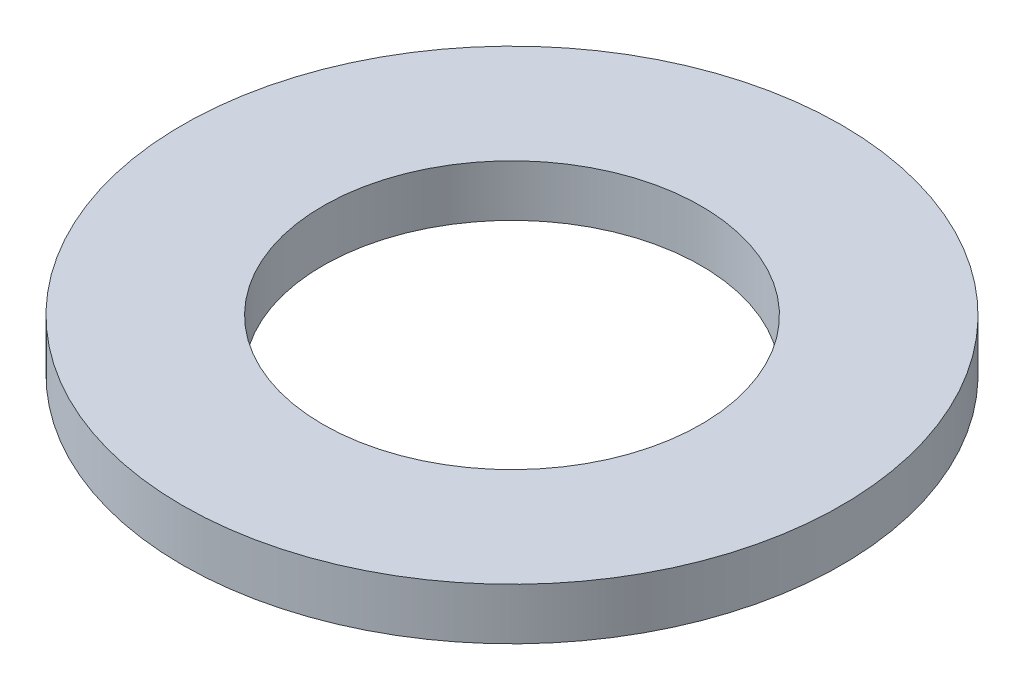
ISO-10303-21;
HEADER;
FILE_DESCRIPTION(('STEP AP214'),'2;1');
FILE_NAME('part.step','',(''),(''),'','','');
FILE_SCHEMA(('AUTOMOTIVE_DESIGN { 1 0 10303 214 1 1 1 1 }'));
ENDSEC;
DATA;
#1=APPLICATION_CONTEXT('core data for automotive mechanical design processes');
#2=APPLICATION_PROTOCOL_DEFINITION('international standard','automotive_design',2000,#1);
#3=PRODUCT_CONTEXT('',#1,'mechanical');
#4=PRODUCT('Part','Part','',(#3));
#5=PRODUCT_RELATED_PRODUCT_CATEGORY('part','',(#4));
#6=PRODUCT_DEFINITION_FORMATION('','',#4);
#7=PRODUCT_DEFINITION_CONTEXT('part definition',#1,'design');
#8=PRODUCT_DEFINITION('design','',#6,#7);
#9=PRODUCT_DEFINITION_SHAPE('','',#8);
#10=(LENGTH_UNIT() NAMED_UNIT(*) SI_UNIT(.MILLI.,.METRE.));
#11=(NAMED_UNIT(*) PLANE_ANGLE_UNIT() SI_UNIT($,.RADIAN.));
#12=(NAMED_UNIT(*) SI_UNIT($,.STERADIAN.) SOLID_ANGLE_UNIT());
#13=UNCERTAINTY_MEASURE_WITH_UNIT(LENGTH_MEASURE(1.E-05),#10,'distance_accuracy_value','');
#14=(GEOMETRIC_REPRESENTATION_CONTEXT(3) GLOBAL_UNCERTAINTY_ASSIGNED_CONTEXT((#13)) GLOBAL_UNIT_ASSIGNED_CONTEXT((#10,
#11,#12)) REPRESENTATION_CONTEXT('',''));
#15=CARTESIAN_POINT('',(0.,0.,0.));
#16=DIRECTION('',(0.,0.,1.));
#17=DIRECTION('',(1.,0.,0.));
#18=AXIS2_PLACEMENT_3D('',#15,#16,#17);
#19=CARTESIAN_POINT('',(0.,9.,0.));
#20=DIRECTION('',(0.,1.,0.));
#21=DIRECTION('',(0.,0.,1.));
#22=AXIS2_PLACEMENT_3D('',#19,#20,#21);
#23=PLANE('',#22);
#24=CARTESIAN_POINT('',(0.,9.,0.));
#25=DIRECTION('',(0.,1.,0.));
#26=DIRECTION('',(0.,0.,1.));
#27=AXIS2_PLACEMENT_3D('',#24,#25,#26);
#28=CIRCLE('',#27,57.5);
#29=CARTESIAN_POINT('',(0.,9.,57.5));
#30=VERTEX_POINT('',#29);
#31=EDGE_CURVE('E10',#30,#30,#28,.T.);
#32=ORIENTED_EDGE('',*,*,#31,.T.);
#33=EDGE_LOOP('',(#32));
#34=FACE_BOUND('',#33,.T.);
#35=CARTESIAN_POINT('',(0.,9.,0.));
#36=DIRECTION('',(0.,1.,0.));
#37=DIRECTION('',(0.,0.,1.));
#38=AXIS2_PLACEMENT_3D('',#35,#36,#37);
#39=CIRCLE('',#38,33.);
#40=CARTESIAN_POINT('',(0.,9.,33.));
#41=VERTEX_POINT('',#40);
#42=EDGE_CURVE('E39',#41,#41,#39,.T.);
#43=ORIENTED_EDGE('',*,*,#42,.F.);
#44=EDGE_LOOP('',(#43));
#45=FACE_BOUND('',#44,.T.);
#46=ADVANCED_FACE('F28',(#34,#45),#23,.T.);
#47=CARTESIAN_POINT('',(0.,0.,0.));
#48=DIRECTION('',(0.,1.,0.));
#49=DIRECTION('',(0.,0.,1.));
#50=AXIS2_PLACEMENT_3D('',#47,#48,#49);
#51=PLANE('',#50);
#52=CARTESIAN_POINT('',(0.,0.,0.));
#53=DIRECTION('',(0.,1.,0.));
#54=DIRECTION('',(0.,0.,1.));
#55=AXIS2_PLACEMENT_3D('',#52,#53,#54);
#56=CIRCLE('',#55,57.5);
#57=CARTESIAN_POINT('',(0.,0.,57.5));
#58=VERTEX_POINT('',#57);
#59=EDGE_CURVE('E35',#58,#58,#56,.T.);
#60=ORIENTED_EDGE('',*,*,#59,.F.);
#61=EDGE_LOOP('',(#60));
#62=FACE_BOUND('',#61,.T.);
#63=CARTESIAN_POINT('',(0.,0.,0.));
#64=DIRECTION('',(0.,1.,0.));
#65=DIRECTION('',(0.,0.,1.));
#66=AXIS2_PLACEMENT_3D('',#63,#64,#65);
#67=CIRCLE('',#66,33.);
#68=CARTESIAN_POINT('',(0.,0.,33.));
#69=VERTEX_POINT('',#68);
#70=EDGE_CURVE('E43',#69,#69,#67,.T.);
#71=ORIENTED_EDGE('',*,*,#70,.T.);
#72=EDGE_LOOP('',(#71));
#73=FACE_BOUND('',#72,.T.);
#74=ADVANCED_FACE('F49',(#62,#73),#51,.F.);
#75=CARTESIAN_POINT('',(0.,9.,0.));
#76=DIRECTION('',(0.,-1.,0.));
#77=DIRECTION('',(0.,0.,-1.));
#78=AXIS2_PLACEMENT_3D('',#75,#76,#77);
#79=CYLINDRICAL_SURFACE('',#78,57.5);
#80=ORIENTED_EDGE('',*,*,#31,.F.);
#81=EDGE_LOOP('',(#80));
#82=FACE_BOUND('',#81,.T.);
#83=ORIENTED_EDGE('',*,*,#59,.T.);
#84=EDGE_LOOP('',(#83));
#85=FACE_BOUND('',#84,.T.);
#86=ADVANCED_FACE('F30',(#82,#85),#79,.T.);
#87=CARTESIAN_POINT('',(0.,9.,0.));
#88=DIRECTION('',(0.,-1.,0.));
#89=DIRECTION('',(0.,0.,-1.));
#90=AXIS2_PLACEMENT_3D('',#87,#88,#89);
#91=CYLINDRICAL_SURFACE('',#90,33.);
#92=ORIENTED_EDGE('',*,*,#42,.T.);
#93=EDGE_LOOP('',(#92));
#94=FACE_BOUND('',#93,.T.);
#95=ORIENTED_EDGE('',*,*,#70,.F.);
#96=EDGE_LOOP('',(#95));
#97=FACE_BOUND('',#96,.T.);
#98=ADVANCED_FACE('F51',(#94,#97),#91,.F.);
#99=CLOSED_SHELL('',(#46,#74,#86,#98));
#100=MANIFOLD_SOLID_BREP('B2',#99);
#101=ADVANCED_BREP_SHAPE_REPRESENTATION('',(#18,#100),#14);
#102=SHAPE_DEFINITION_REPRESENTATION(#9,#101);
ENDSEC;
END-ISO-10303-21;
